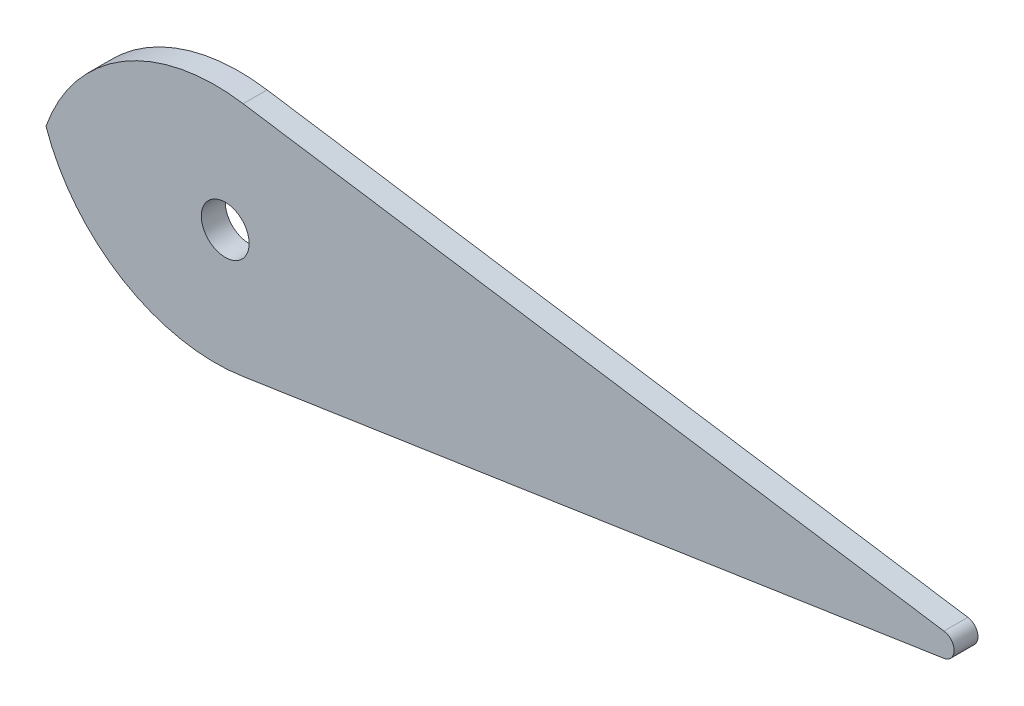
ISO-10303-21;
HEADER;
FILE_DESCRIPTION(('STEP AP214'),'2;1');
FILE_NAME('part.step','',(''),(''),'','','');
FILE_SCHEMA(('AUTOMOTIVE_DESIGN { 1 0 10303 214 1 1 1 1 }'));
ENDSEC;
DATA;
#1=APPLICATION_CONTEXT('core data for automotive mechanical design processes');
#2=APPLICATION_PROTOCOL_DEFINITION('international standard','automotive_design',2000,#1);
#3=PRODUCT_CONTEXT('',#1,'mechanical');
#4=PRODUCT('Part','Part','',(#3));
#5=PRODUCT_RELATED_PRODUCT_CATEGORY('part','',(#4));
#6=PRODUCT_DEFINITION_FORMATION('','',#4);
#7=PRODUCT_DEFINITION_CONTEXT('part definition',#1,'design');
#8=PRODUCT_DEFINITION('design','',#6,#7);
#9=PRODUCT_DEFINITION_SHAPE('','',#8);
#10=(LENGTH_UNIT() NAMED_UNIT(*) SI_UNIT(.MILLI.,.METRE.));
#11=(NAMED_UNIT(*) PLANE_ANGLE_UNIT() SI_UNIT($,.RADIAN.));
#12=(NAMED_UNIT(*) SI_UNIT($,.STERADIAN.) SOLID_ANGLE_UNIT());
#13=UNCERTAINTY_MEASURE_WITH_UNIT(LENGTH_MEASURE(1.E-05),#10,'distance_accuracy_value','');
#14=(GEOMETRIC_REPRESENTATION_CONTEXT(3) GLOBAL_UNCERTAINTY_ASSIGNED_CONTEXT((#13)) GLOBAL_UNIT_ASSIGNED_CONTEXT((#10,
#11,#12)) REPRESENTATION_CONTEXT('',''));
#15=CARTESIAN_POINT('',(0.,0.,0.));
#16=DIRECTION('',(0.,0.,1.));
#17=DIRECTION('',(1.,0.,0.));
#18=AXIS2_PLACEMENT_3D('',#15,#16,#17);
#19=CARTESIAN_POINT('',(-0.0416745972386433,0.246526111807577,0.1));
#20=DIRECTION('',(0.,0.,-1.));
#21=DIRECTION('',(-1.,0.,0.));
#22=AXIS2_PLACEMENT_3D('',#19,#20,#21);
#23=PLANE('',#22);
#24=CARTESIAN_POINT('',(-0.0416745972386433,0.246526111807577,0.1));
#25=DIRECTION('',(0.,0.,1.));
#26=DIRECTION('',(-1.,0.,0.));
#27=AXIS2_PLACEMENT_3D('',#24,#25,#26);
#28=CIRCLE('',#27,0.75);
#29=CARTESIAN_POINT('',(-0.75,0.,0.1));
#30=VERTEX_POINT('',#29);
#31=CARTESIAN_POINT('',(0.075,-0.49434299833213,0.1));
#32=VERTEX_POINT('',#31);
#33=EDGE_CURVE('E118',#30,#32,#28,.T.);
#34=ORIENTED_EDGE('',*,*,#33,.T.);
#35=DIRECTION('',(0.988685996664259,0.15,0.));
#36=VECTOR('',#35,1.);
#37=CARTESIAN_POINT('',(3.0075,-0.049434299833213,0.1));
#38=LINE('',#37,#36);
#39=CARTESIAN_POINT('',(3.0075,-0.0494342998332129,0.1));
#40=VERTEX_POINT('',#39);
#41=EDGE_CURVE('E85',#32,#40,#38,.T.);
#42=ORIENTED_EDGE('',*,*,#41,.T.);
#43=CARTESIAN_POINT('',(3.,0.,0.1));
#44=DIRECTION('',(0.,0.,1.));
#45=DIRECTION('',(1.,0.,0.));
#46=AXIS2_PLACEMENT_3D('',#43,#44,#45);
#47=CIRCLE('',#46,0.05);
#48=CARTESIAN_POINT('',(3.0075,0.0494342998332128,0.1));
#49=VERTEX_POINT('',#48);
#50=EDGE_CURVE('E89',#40,#49,#47,.T.);
#51=ORIENTED_EDGE('',*,*,#50,.T.);
#52=DIRECTION('',(-0.988685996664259,0.15,0.));
#53=VECTOR('',#52,1.);
#54=CARTESIAN_POINT('',(0.075,0.49434299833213,0.1));
#55=LINE('',#54,#53);
#56=CARTESIAN_POINT('',(0.0750000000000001,0.49434299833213,0.1));
#57=VERTEX_POINT('',#56);
#58=EDGE_CURVE('E93',#49,#57,#55,.T.);
#59=ORIENTED_EDGE('',*,*,#58,.T.);
#60=CARTESIAN_POINT('',(-0.0416745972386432,-0.246526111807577,0.1));
#61=DIRECTION('',(0.,0.,1.));
#62=DIRECTION('',(-1.,0.,0.));
#63=AXIS2_PLACEMENT_3D('',#60,#61,#62);
#64=CIRCLE('',#63,0.75);
#65=EDGE_CURVE('E51',#57,#30,#64,.T.);
#66=ORIENTED_EDGE('',*,*,#65,.T.);
#67=EDGE_LOOP('',(#34,#42,#51,#59,#66));
#68=FACE_BOUND('',#67,.T.);
#69=CARTESIAN_POINT('',(0.,0.,0.1));
#70=DIRECTION('',(0.,0.,1.));
#71=DIRECTION('',(1.,0.,0.));
#72=AXIS2_PLACEMENT_3D('',#69,#70,#71);
#73=CIRCLE('',#72,0.1);
#74=CARTESIAN_POINT('',(0.1,0.,0.1));
#75=VERTEX_POINT('',#74);
#76=EDGE_CURVE('E113',#75,#75,#73,.T.);
#77=ORIENTED_EDGE('',*,*,#76,.F.);
#78=EDGE_LOOP('',(#77));
#79=FACE_BOUND('',#78,.T.);
#80=ADVANCED_FACE('F34',(#68,#79),#23,.F.);
#81=CARTESIAN_POINT('',(-0.0416745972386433,0.246526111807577,0.));
#82=DIRECTION('',(0.,0.,-1.));
#83=DIRECTION('',(-1.,0.,0.));
#84=AXIS2_PLACEMENT_3D('',#81,#82,#83);
#85=PLANE('',#84);
#86=CARTESIAN_POINT('',(-0.0416745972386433,0.246526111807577,0.));
#87=DIRECTION('',(0.,0.,1.));
#88=DIRECTION('',(-1.,0.,0.));
#89=AXIS2_PLACEMENT_3D('',#86,#87,#88);
#90=CIRCLE('',#89,0.75);
#91=CARTESIAN_POINT('',(-0.75,0.,0.));
#92=VERTEX_POINT('',#91);
#93=CARTESIAN_POINT('',(0.075,-0.49434299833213,0.));
#94=VERTEX_POINT('',#93);
#95=EDGE_CURVE('E109',#92,#94,#90,.T.);
#96=ORIENTED_EDGE('',*,*,#95,.F.);
#97=CARTESIAN_POINT('',(-0.0416745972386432,-0.246526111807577,0.));
#98=DIRECTION('',(0.,0.,1.));
#99=DIRECTION('',(-1.,0.,0.));
#100=AXIS2_PLACEMENT_3D('',#97,#98,#99);
#101=CIRCLE('',#100,0.75);
#102=CARTESIAN_POINT('',(0.0750000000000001,0.49434299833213,0.));
#103=VERTEX_POINT('',#102);
#104=EDGE_CURVE('E77',#103,#92,#101,.T.);
#105=ORIENTED_EDGE('',*,*,#104,.F.);
#106=DIRECTION('',(-0.988685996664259,0.15,0.));
#107=VECTOR('',#106,1.);
#108=CARTESIAN_POINT('',(0.075,0.49434299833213,0.));
#109=LINE('',#108,#107);
#110=CARTESIAN_POINT('',(3.0075,0.0494342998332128,0.));
#111=VERTEX_POINT('',#110);
#112=EDGE_CURVE('E71',#111,#103,#109,.T.);
#113=ORIENTED_EDGE('',*,*,#112,.F.);
#114=CARTESIAN_POINT('',(3.,0.,0.));
#115=DIRECTION('',(0.,0.,1.));
#116=DIRECTION('',(1.,0.,0.));
#117=AXIS2_PLACEMENT_3D('',#114,#115,#116);
#118=CIRCLE('',#117,0.05);
#119=CARTESIAN_POINT('',(3.0075,-0.0494342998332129,0.));
#120=VERTEX_POINT('',#119);
#121=EDGE_CURVE('E100',#120,#111,#118,.T.);
#122=ORIENTED_EDGE('',*,*,#121,.F.);
#123=DIRECTION('',(0.988685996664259,0.15,0.));
#124=VECTOR('',#123,1.);
#125=CARTESIAN_POINT('',(3.0075,-0.049434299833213,0.));
#126=LINE('',#125,#124);
#127=EDGE_CURVE('E112',#94,#120,#126,.T.);
#128=ORIENTED_EDGE('',*,*,#127,.F.);
#129=EDGE_LOOP('',(#96,#105,#113,#122,#128));
#130=FACE_BOUND('',#129,.T.);
#131=CARTESIAN_POINT('',(0.,0.,0.));
#132=DIRECTION('',(0.,0.,1.));
#133=DIRECTION('',(1.,0.,0.));
#134=AXIS2_PLACEMENT_3D('',#131,#132,#133);
#135=CIRCLE('',#134,0.1);
#136=CARTESIAN_POINT('',(0.1,0.,0.));
#137=VERTEX_POINT('',#136);
#138=EDGE_CURVE('E198',#137,#137,#135,.T.);
#139=ORIENTED_EDGE('',*,*,#138,.T.);
#140=EDGE_LOOP('',(#139));
#141=FACE_BOUND('',#140,.T.);
#142=ADVANCED_FACE('F122',(#130,#141),#85,.T.);
#143=CARTESIAN_POINT('',(-0.0416745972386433,0.246526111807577,0.1));
#144=DIRECTION('',(0.,0.,-1.));
#145=DIRECTION('',(-1.,0.,0.));
#146=AXIS2_PLACEMENT_3D('',#143,#144,#145);
#147=CYLINDRICAL_SURFACE('',#146,0.75);
#148=ORIENTED_EDGE('',*,*,#95,.T.);
#149=DIRECTION('',(0.,0.,-1.));
#150=VECTOR('',#149,1.);
#151=CARTESIAN_POINT('',(0.075,-0.49434299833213,0.1));
#152=LINE('',#151,#150);
#153=EDGE_CURVE('E11',#32,#94,#152,.T.);
#154=ORIENTED_EDGE('',*,*,#153,.F.);
#155=ORIENTED_EDGE('',*,*,#33,.F.);
#156=DIRECTION('',(0.,0.,-1.));
#157=VECTOR('',#156,1.);
#158=CARTESIAN_POINT('',(-0.75,0.,0.1));
#159=LINE('',#158,#157);
#160=EDGE_CURVE('E105',#30,#92,#159,.T.);
#161=ORIENTED_EDGE('',*,*,#160,.T.);
#162=EDGE_LOOP('',(#148,#154,#155,#161));
#163=FACE_BOUND('',#162,.T.);
#164=ADVANCED_FACE('F36',(#163),#147,.T.);
#165=CARTESIAN_POINT('',(3.0075,-0.049434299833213,0.1));
#166=DIRECTION('',(-0.15,0.988685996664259,0.));
#167=DIRECTION('',(-0.988685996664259,-0.15,0.));
#168=AXIS2_PLACEMENT_3D('',#165,#166,#167);
#169=PLANE('',#168);
#170=ORIENTED_EDGE('',*,*,#127,.T.);
#171=DIRECTION('',(0.,0.,-1.));
#172=VECTOR('',#171,1.);
#173=CARTESIAN_POINT('',(3.0075,-0.0494342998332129,0.1));
#174=LINE('',#173,#172);
#175=EDGE_CURVE('E43',#40,#120,#174,.T.);
#176=ORIENTED_EDGE('',*,*,#175,.F.);
#177=ORIENTED_EDGE('',*,*,#41,.F.);
#178=ORIENTED_EDGE('',*,*,#153,.T.);
#179=EDGE_LOOP('',(#170,#176,#177,#178));
#180=FACE_BOUND('',#179,.T.);
#181=ADVANCED_FACE('F147',(#180),#169,.F.);
#182=CARTESIAN_POINT('',(3.,0.,0.1));
#183=DIRECTION('',(0.,0.,-1.));
#184=DIRECTION('',(-1.,0.,0.));
#185=AXIS2_PLACEMENT_3D('',#182,#183,#184);
#186=CYLINDRICAL_SURFACE('',#185,0.05);
#187=ORIENTED_EDGE('',*,*,#121,.T.);
#188=DIRECTION('',(0.,0.,-1.));
#189=VECTOR('',#188,1.);
#190=CARTESIAN_POINT('',(3.0075,0.0494342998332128,0.1));
#191=LINE('',#190,#189);
#192=EDGE_CURVE('E97',#49,#111,#191,.T.);
#193=ORIENTED_EDGE('',*,*,#192,.F.);
#194=ORIENTED_EDGE('',*,*,#50,.F.);
#195=ORIENTED_EDGE('',*,*,#175,.T.);
#196=EDGE_LOOP('',(#187,#193,#194,#195));
#197=FACE_BOUND('',#196,.T.);
#198=ADVANCED_FACE('F98',(#197),#186,.T.);
#199=CARTESIAN_POINT('',(0.075,0.49434299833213,0.1));
#200=DIRECTION('',(-0.15,-0.988685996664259,0.));
#201=DIRECTION('',(0.988685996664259,-0.15,0.));
#202=AXIS2_PLACEMENT_3D('',#199,#200,#201);
#203=PLANE('',#202);
#204=ORIENTED_EDGE('',*,*,#112,.T.);
#205=DIRECTION('',(0.,0.,-1.));
#206=VECTOR('',#205,1.);
#207=CARTESIAN_POINT('',(0.0750000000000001,0.49434299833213,0.1));
#208=LINE('',#207,#206);
#209=EDGE_CURVE('E101',#57,#103,#208,.T.);
#210=ORIENTED_EDGE('',*,*,#209,.F.);
#211=ORIENTED_EDGE('',*,*,#58,.F.);
#212=ORIENTED_EDGE('',*,*,#192,.T.);
#213=EDGE_LOOP('',(#204,#210,#211,#212));
#214=FACE_BOUND('',#213,.T.);
#215=ADVANCED_FACE('F103',(#214),#203,.F.);
#216=CARTESIAN_POINT('',(-0.0416745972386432,-0.246526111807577,0.1));
#217=DIRECTION('',(0.,0.,-1.));
#218=DIRECTION('',(-1.,0.,0.));
#219=AXIS2_PLACEMENT_3D('',#216,#217,#218);
#220=CYLINDRICAL_SURFACE('',#219,0.75);
#221=ORIENTED_EDGE('',*,*,#104,.T.);
#222=ORIENTED_EDGE('',*,*,#160,.F.);
#223=ORIENTED_EDGE('',*,*,#65,.F.);
#224=ORIENTED_EDGE('',*,*,#209,.T.);
#225=EDGE_LOOP('',(#221,#222,#223,#224));
#226=FACE_BOUND('',#225,.T.);
#227=ADVANCED_FACE('F127',(#226),#220,.T.);
#228=CARTESIAN_POINT('',(0.,0.,0.1));
#229=DIRECTION('',(0.,0.,-1.));
#230=DIRECTION('',(-1.,0.,0.));
#231=AXIS2_PLACEMENT_3D('',#228,#229,#230);
#232=CYLINDRICAL_SURFACE('',#231,0.1);
#233=ORIENTED_EDGE('',*,*,#76,.T.);
#234=EDGE_LOOP('',(#233));
#235=FACE_BOUND('',#234,.T.);
#236=ORIENTED_EDGE('',*,*,#138,.F.);
#237=EDGE_LOOP('',(#236));
#238=FACE_BOUND('',#237,.T.);
#239=ADVANCED_FACE('F129',(#235,#238),#232,.F.);
#240=CLOSED_SHELL('',(#80,#142,#164,#181,#198,#215,#227,#239));
#241=MANIFOLD_SOLID_BREP('B2',#240);
#242=ADVANCED_BREP_SHAPE_REPRESENTATION('',(#18,#241),#14);
#243=SHAPE_DEFINITION_REPRESENTATION(#9,#242);
ENDSEC;
END-ISO-10303-21;
